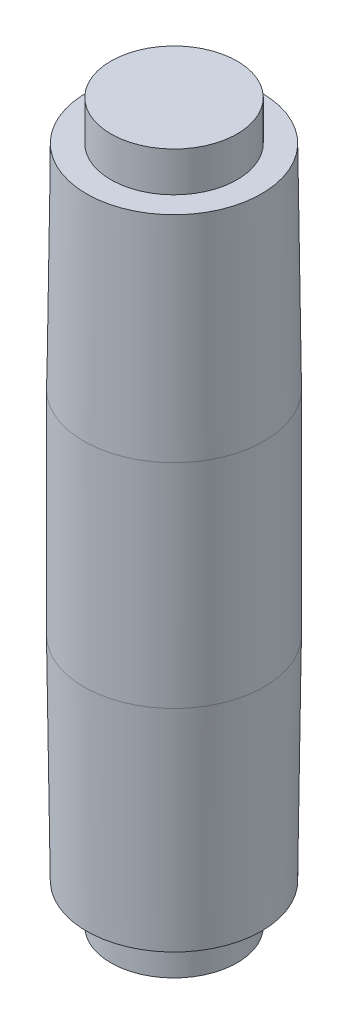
ISO-10303-21;
HEADER;
FILE_DESCRIPTION(('STEP AP214'),'2;1');
FILE_NAME('part.step','',(''),(''),'','','');
FILE_SCHEMA(('AUTOMOTIVE_DESIGN { 1 0 10303 214 1 1 1 1 }'));
ENDSEC;
DATA;
#1=APPLICATION_CONTEXT('core data for automotive mechanical design processes');
#2=APPLICATION_PROTOCOL_DEFINITION('international standard','automotive_design',2000,#1);
#3=PRODUCT_CONTEXT('',#1,'mechanical');
#4=PRODUCT('Part','Part','',(#3));
#5=PRODUCT_RELATED_PRODUCT_CATEGORY('part','',(#4));
#6=PRODUCT_DEFINITION_FORMATION('','',#4);
#7=PRODUCT_DEFINITION_CONTEXT('part definition',#1,'design');
#8=PRODUCT_DEFINITION('design','',#6,#7);
#9=PRODUCT_DEFINITION_SHAPE('','',#8);
#10=(LENGTH_UNIT() NAMED_UNIT(*) SI_UNIT(.MILLI.,.METRE.));
#11=(NAMED_UNIT(*) PLANE_ANGLE_UNIT() SI_UNIT($,.RADIAN.));
#12=(NAMED_UNIT(*) SI_UNIT($,.STERADIAN.) SOLID_ANGLE_UNIT());
#13=UNCERTAINTY_MEASURE_WITH_UNIT(LENGTH_MEASURE(1.E-05),#10,'distance_accuracy_value','');
#14=(GEOMETRIC_REPRESENTATION_CONTEXT(3) GLOBAL_UNCERTAINTY_ASSIGNED_CONTEXT((#13)) GLOBAL_UNIT_ASSIGNED_CONTEXT((#10,
#11,#12)) REPRESENTATION_CONTEXT('',''));
#15=CARTESIAN_POINT('',(0.,0.,0.));
#16=DIRECTION('',(0.,0.,1.));
#17=DIRECTION('',(1.,0.,0.));
#18=AXIS2_PLACEMENT_3D('',#15,#16,#17);
#19=CARTESIAN_POINT('',(0.,189.5,0.));
#20=DIRECTION('',(0.,1.,0.));
#21=DIRECTION('',(0.,0.,1.));
#22=AXIS2_PLACEMENT_3D('',#19,#20,#21);
#23=PLANE('',#22);
#24=CARTESIAN_POINT('',(0.,189.5,0.));
#25=DIRECTION('',(0.,1.,0.));
#26=DIRECTION('',(-1.,0.,0.));
#27=AXIS2_PLACEMENT_3D('',#24,#25,#26);
#28=CIRCLE('',#27,17.5);
#29=CARTESIAN_POINT('',(-17.4999999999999,189.5,0.));
#30=VERTEX_POINT('',#29);
#31=EDGE_CURVE('E17',#30,#30,#28,.F.);
#32=ORIENTED_EDGE('',*,*,#31,.F.);
#33=EDGE_LOOP('',(#32));
#34=FACE_BOUND('',#33,.T.);
#35=ADVANCED_FACE('F14',(#34),#23,.T.);
#36=CARTESIAN_POINT('',(0.,-9.5,0.));
#37=DIRECTION('',(0.,-1.,0.));
#38=DIRECTION('',(0.,0.,-1.));
#39=AXIS2_PLACEMENT_3D('',#36,#37,#38);
#40=PLANE('',#39);
#41=CARTESIAN_POINT('',(0.,-9.5,0.));
#42=DIRECTION('',(0.,1.,0.));
#43=DIRECTION('',(-1.,0.,0.));
#44=AXIS2_PLACEMENT_3D('',#41,#42,#43);
#45=CIRCLE('',#44,17.5);
#46=CARTESIAN_POINT('',(-17.5,-9.5,0.));
#47=VERTEX_POINT('',#46);
#48=EDGE_CURVE('E39',#47,#47,#45,.T.);
#49=ORIENTED_EDGE('',*,*,#48,.F.);
#50=EDGE_LOOP('',(#49));
#51=FACE_BOUND('',#50,.T.);
#52=ADVANCED_FACE('F49',(#51),#40,.T.);
#53=CARTESIAN_POINT('',(0.,178.5,0.));
#54=DIRECTION('',(0.,1.,0.));
#55=DIRECTION('',(-1.,0.,0.));
#56=AXIS2_PLACEMENT_3D('',#53,#54,#55);
#57=CYLINDRICAL_SURFACE('',#56,17.5);
#58=CARTESIAN_POINT('',(0.,178.5,0.));
#59=DIRECTION('',(0.,1.,0.));
#60=DIRECTION('',(-1.,0.,0.));
#61=AXIS2_PLACEMENT_3D('',#58,#59,#60);
#62=CIRCLE('',#61,17.5);
#63=CARTESIAN_POINT('',(-17.4999999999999,178.5,0.));
#64=VERTEX_POINT('',#63);
#65=EDGE_CURVE('E37',#64,#64,#62,.F.);
#66=ORIENTED_EDGE('',*,*,#65,.F.);
#67=EDGE_LOOP('',(#66));
#68=FACE_BOUND('',#67,.T.);
#69=ORIENTED_EDGE('',*,*,#31,.T.);
#70=EDGE_LOOP('',(#69));
#71=FACE_BOUND('',#70,.T.);
#72=ADVANCED_FACE('F46',(#68,#71),#57,.T.);
#73=CARTESIAN_POINT('',(0.,-9.5,0.));
#74=DIRECTION('',(0.,1.,0.));
#75=DIRECTION('',(-1.,0.,0.));
#76=AXIS2_PLACEMENT_3D('',#73,#74,#75);
#77=CYLINDRICAL_SURFACE('',#76,17.5);
#78=ORIENTED_EDGE('',*,*,#48,.T.);
#79=EDGE_LOOP('',(#78));
#80=FACE_BOUND('',#79,.T.);
#81=CARTESIAN_POINT('',(0.,1.5,0.));
#82=DIRECTION('',(0.,1.,0.));
#83=DIRECTION('',(-1.,0.,0.));
#84=AXIS2_PLACEMENT_3D('',#81,#82,#83);
#85=CIRCLE('',#84,17.5);
#86=CARTESIAN_POINT('',(-17.5,1.50000000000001,0.));
#87=VERTEX_POINT('',#86);
#88=EDGE_CURVE('E34',#87,#87,#85,.T.);
#89=ORIENTED_EDGE('',*,*,#88,.F.);
#90=EDGE_LOOP('',(#89));
#91=FACE_BOUND('',#90,.T.);
#92=ADVANCED_FACE('F77',(#80,#91),#77,.T.);
#93=CARTESIAN_POINT('',(0.,178.5,0.));
#94=DIRECTION('',(0.,1.,0.));
#95=DIRECTION('',(0.,0.,1.));
#96=AXIS2_PLACEMENT_3D('',#93,#94,#95);
#97=PLANE('',#96);
#98=ORIENTED_EDGE('',*,*,#65,.T.);
#99=EDGE_LOOP('',(#98));
#100=FACE_BOUND('',#99,.T.);
#101=CARTESIAN_POINT('',(0.,178.5,0.));
#102=DIRECTION('',(0.,-1.,0.));
#103=DIRECTION('',(0.,0.,-1.));
#104=AXIS2_PLACEMENT_3D('',#101,#102,#103);
#105=CIRCLE('',#104,24.2585451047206);
#106=CARTESIAN_POINT('',(0.,178.5,-24.2585451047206));
#107=VERTEX_POINT('',#106);
#108=EDGE_CURVE('E31',#107,#107,#105,.T.);
#109=ORIENTED_EDGE('',*,*,#108,.F.);
#110=EDGE_LOOP('',(#109));
#111=FACE_BOUND('',#110,.T.);
#112=ADVANCED_FACE('F73',(#100,#111),#97,.T.);
#113=CARTESIAN_POINT('',(0.,1.5,0.));
#114=DIRECTION('',(0.,-1.,0.));
#115=DIRECTION('',(0.,0.,-1.));
#116=AXIS2_PLACEMENT_3D('',#113,#114,#115);
#117=PLANE('',#116);
#118=ORIENTED_EDGE('',*,*,#88,.T.);
#119=EDGE_LOOP('',(#118));
#120=FACE_BOUND('',#119,.T.);
#121=CARTESIAN_POINT('',(0.,1.50000000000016,0.));
#122=DIRECTION('',(0.,1.,0.));
#123=DIRECTION('',(-1.,0.,0.));
#124=AXIS2_PLACEMENT_3D('',#121,#122,#123);
#125=CIRCLE('',#124,24.2585451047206);
#126=CARTESIAN_POINT('',(-24.2585451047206,1.50000000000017,0.));
#127=VERTEX_POINT('',#126);
#128=EDGE_CURVE('E26',#127,#127,#125,.T.);
#129=ORIENTED_EDGE('',*,*,#128,.F.);
#130=EDGE_LOOP('',(#129));
#131=FACE_BOUND('',#130,.T.);
#132=ADVANCED_FACE('F69',(#120,#131),#117,.T.);
#133=CARTESIAN_POINT('',(0.,119.499999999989,0.));
#134=DIRECTION('',(0.,-1.,0.));
#135=DIRECTION('',(0.,0.,-1.));
#136=AXIS2_PLACEMENT_3D('',#133,#134,#135);
#137=CONICAL_SURFACE('',#136,24.9999999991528,0.0125663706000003);
#138=ORIENTED_EDGE('',*,*,#108,.T.);
#139=EDGE_LOOP('',(#138));
#140=FACE_BOUND('',#139,.T.);
#141=CARTESIAN_POINT('',(0.,119.5,0.));
#142=DIRECTION('',(0.,1.,0.));
#143=DIRECTION('',(-1.,0.,0.));
#144=AXIS2_PLACEMENT_3D('',#141,#142,#143);
#145=CIRCLE('',#144,25.);
#146=CARTESIAN_POINT('',(-24.9999999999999,119.5,0.));
#147=VERTEX_POINT('',#146);
#148=EDGE_CURVE('E21',#147,#147,#145,.F.);
#149=ORIENTED_EDGE('',*,*,#148,.F.);
#150=EDGE_LOOP('',(#149));
#151=FACE_BOUND('',#150,.T.);
#152=ADVANCED_FACE('F62',(#140,#151),#137,.T.);
#153=CARTESIAN_POINT('',(0.,60.5000000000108,0.));
#154=DIRECTION('',(0.,1.,0.));
#155=DIRECTION('',(-1.,0.,0.));
#156=AXIS2_PLACEMENT_3D('',#153,#154,#155);
#157=CONICAL_SURFACE('',#156,24.9999999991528,0.0125663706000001);
#158=ORIENTED_EDGE('',*,*,#128,.T.);
#159=EDGE_LOOP('',(#158));
#160=FACE_BOUND('',#159,.T.);
#161=CARTESIAN_POINT('',(0.,60.5,0.));
#162=DIRECTION('',(0.,1.,0.));
#163=DIRECTION('',(-1.,0.,0.));
#164=AXIS2_PLACEMENT_3D('',#161,#162,#163);
#165=CIRCLE('',#164,25.);
#166=CARTESIAN_POINT('',(-25.,60.5,0.));
#167=VERTEX_POINT('',#166);
#168=EDGE_CURVE('E10',#167,#167,#165,.T.);
#169=ORIENTED_EDGE('',*,*,#168,.F.);
#170=EDGE_LOOP('',(#169));
#171=FACE_BOUND('',#170,.T.);
#172=ADVANCED_FACE('F57',(#160,#171),#157,.T.);
#173=CARTESIAN_POINT('',(0.,60.5,0.));
#174=DIRECTION('',(0.,1.,0.));
#175=DIRECTION('',(-1.,0.,0.));
#176=AXIS2_PLACEMENT_3D('',#173,#174,#175);
#177=CYLINDRICAL_SURFACE('',#176,25.);
#178=ORIENTED_EDGE('',*,*,#168,.T.);
#179=EDGE_LOOP('',(#178));
#180=FACE_BOUND('',#179,.T.);
#181=ORIENTED_EDGE('',*,*,#148,.T.);
#182=EDGE_LOOP('',(#181));
#183=FACE_BOUND('',#182,.T.);
#184=ADVANCED_FACE('F55',(#180,#183),#177,.T.);
#185=CLOSED_SHELL('',(#35,#52,#72,#92,#112,#132,#152,#172,#184));
#186=MANIFOLD_SOLID_BREP('B1',#185);
#187=ADVANCED_BREP_SHAPE_REPRESENTATION('',(#18,#186),#14);
#188=SHAPE_DEFINITION_REPRESENTATION(#9,#187);
ENDSEC;
END-ISO-10303-21;
